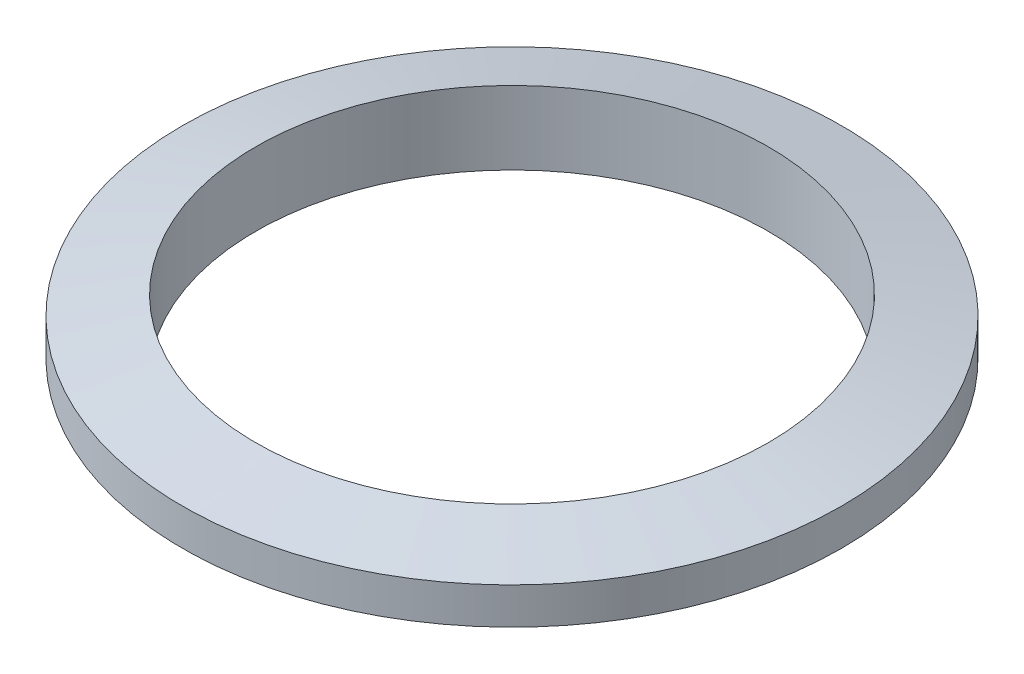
ISO-10303-21;
HEADER;
FILE_DESCRIPTION(('STEP AP214'),'2;1');
FILE_NAME('part.step','',(''),(''),'','','');
FILE_SCHEMA(('AUTOMOTIVE_DESIGN { 1 0 10303 214 1 1 1 1 }'));
ENDSEC;
DATA;
#1=APPLICATION_CONTEXT('core data for automotive mechanical design processes');
#2=APPLICATION_PROTOCOL_DEFINITION('international standard','automotive_design',2000,#1);
#3=PRODUCT_CONTEXT('',#1,'mechanical');
#4=PRODUCT('Part','Part','',(#3));
#5=PRODUCT_RELATED_PRODUCT_CATEGORY('part','',(#4));
#6=PRODUCT_DEFINITION_FORMATION('','',#4);
#7=PRODUCT_DEFINITION_CONTEXT('part definition',#1,'design');
#8=PRODUCT_DEFINITION('design','',#6,#7);
#9=PRODUCT_DEFINITION_SHAPE('','',#8);
#10=(LENGTH_UNIT() NAMED_UNIT(*) SI_UNIT(.MILLI.,.METRE.));
#11=(NAMED_UNIT(*) PLANE_ANGLE_UNIT() SI_UNIT($,.RADIAN.));
#12=(NAMED_UNIT(*) SI_UNIT($,.STERADIAN.) SOLID_ANGLE_UNIT());
#13=UNCERTAINTY_MEASURE_WITH_UNIT(LENGTH_MEASURE(1.E-05),#10,'distance_accuracy_value','');
#14=(GEOMETRIC_REPRESENTATION_CONTEXT(3) GLOBAL_UNCERTAINTY_ASSIGNED_CONTEXT((#13)) GLOBAL_UNIT_ASSIGNED_CONTEXT((#10,
#11,#12)) REPRESENTATION_CONTEXT('',''));
#15=CARTESIAN_POINT('',(0.,0.,0.));
#16=DIRECTION('',(0.,0.,1.));
#17=DIRECTION('',(1.,0.,0.));
#18=AXIS2_PLACEMENT_3D('',#15,#16,#17);
#19=CARTESIAN_POINT('',(0.,8.49999999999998,0.));
#20=DIRECTION('',(0.,1.,0.));
#21=DIRECTION('',(-1.,0.,0.));
#22=AXIS2_PLACEMENT_3D('',#19,#20,#21);
#23=CONICAL_SURFACE('',#22,9.00000000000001,1.32581766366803);
#24=CARTESIAN_POINT('',(0.,7.99999999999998,0.));
#25=DIRECTION('',(0.,-1.,0.));
#26=DIRECTION('',(1.,0.,0.));
#27=AXIS2_PLACEMENT_3D('',#24,#25,#26);
#28=CIRCLE('',#27,7.00000000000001);
#29=CARTESIAN_POINT('',(7.00000000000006,7.99999999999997,0.));
#30=VERTEX_POINT('',#29);
#31=EDGE_CURVE('E43',#30,#30,#28,.T.);
#32=ORIENTED_EDGE('',*,*,#31,.F.);
#33=EDGE_LOOP('',(#32));
#34=FACE_BOUND('',#33,.T.);
#35=CARTESIAN_POINT('',(0.,8.49999999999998,0.));
#36=DIRECTION('',(0.,-1.,0.));
#37=DIRECTION('',(1.,0.,0.));
#38=AXIS2_PLACEMENT_3D('',#35,#36,#37);
#39=CIRCLE('',#38,9.00000000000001);
#40=CARTESIAN_POINT('',(9.00000000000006,8.49999999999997,0.));
#41=VERTEX_POINT('',#40);
#42=EDGE_CURVE('E10',#41,#41,#39,.T.);
#43=ORIENTED_EDGE('',*,*,#42,.T.);
#44=EDGE_LOOP('',(#43));
#45=FACE_BOUND('',#44,.T.);
#46=ADVANCED_FACE('F29',(#34,#45),#23,.T.);
#47=CARTESIAN_POINT('',(0.,-4.10833735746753,0.));
#48=DIRECTION('',(0.,-1.,0.));
#49=DIRECTION('',(1.,0.,0.));
#50=AXIS2_PLACEMENT_3D('',#47,#48,#49);
#51=CYLINDRICAL_SURFACE('',#50,8.99999999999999);
#52=ORIENTED_EDGE('',*,*,#42,.F.);
#53=EDGE_LOOP('',(#52));
#54=FACE_BOUND('',#53,.T.);
#55=CARTESIAN_POINT('',(0.,9.49999999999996,0.));
#56=DIRECTION('',(0.,-1.,0.));
#57=DIRECTION('',(1.,0.,0.));
#58=AXIS2_PLACEMENT_3D('',#55,#56,#57);
#59=CIRCLE('',#58,8.99999999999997);
#60=CARTESIAN_POINT('',(9.00000000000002,9.49999999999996,0.));
#61=VERTEX_POINT('',#60);
#62=EDGE_CURVE('E35',#61,#61,#59,.T.);
#63=ORIENTED_EDGE('',*,*,#62,.T.);
#64=EDGE_LOOP('',(#63));
#65=FACE_BOUND('',#64,.T.);
#66=ADVANCED_FACE('F52',(#54,#65),#51,.T.);
#67=CARTESIAN_POINT('',(0.,9.99999999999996,0.));
#68=DIRECTION('',(0.,-1.,0.));
#69=DIRECTION('',(1.,0.,0.));
#70=AXIS2_PLACEMENT_3D('',#67,#68,#69);
#71=CONICAL_SURFACE('',#70,6.99999999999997,1.32581766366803);
#72=ORIENTED_EDGE('',*,*,#62,.F.);
#73=EDGE_LOOP('',(#72));
#74=FACE_BOUND('',#73,.T.);
#75=CARTESIAN_POINT('',(0.,9.99999999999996,0.));
#76=DIRECTION('',(0.,-1.,0.));
#77=DIRECTION('',(1.,0.,0.));
#78=AXIS2_PLACEMENT_3D('',#75,#76,#77);
#79=CIRCLE('',#78,6.99999999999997);
#80=CARTESIAN_POINT('',(7.00000000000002,9.99999999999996,0.));
#81=VERTEX_POINT('',#80);
#82=EDGE_CURVE('E39',#81,#81,#79,.T.);
#83=ORIENTED_EDGE('',*,*,#82,.T.);
#84=EDGE_LOOP('',(#83));
#85=FACE_BOUND('',#84,.T.);
#86=ADVANCED_FACE('F56',(#74,#85),#71,.T.);
#87=CARTESIAN_POINT('',(0.,-4.10833735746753,0.));
#88=DIRECTION('',(0.,-1.,0.));
#89=DIRECTION('',(1.,0.,0.));
#90=AXIS2_PLACEMENT_3D('',#87,#88,#89);
#91=CYLINDRICAL_SURFACE('',#90,6.99999999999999);
#92=ORIENTED_EDGE('',*,*,#82,.F.);
#93=EDGE_LOOP('',(#92));
#94=FACE_BOUND('',#93,.T.);
#95=ORIENTED_EDGE('',*,*,#31,.T.);
#96=EDGE_LOOP('',(#95));
#97=FACE_BOUND('',#96,.T.);
#98=ADVANCED_FACE('F49',(#94,#97),#91,.F.);
#99=CLOSED_SHELL('',(#46,#66,#86,#98));
#100=MANIFOLD_SOLID_BREP('B2',#99);
#101=ADVANCED_BREP_SHAPE_REPRESENTATION('',(#18,#100),#14);
#102=SHAPE_DEFINITION_REPRESENTATION(#9,#101);
ENDSEC;
END-ISO-10303-21;
